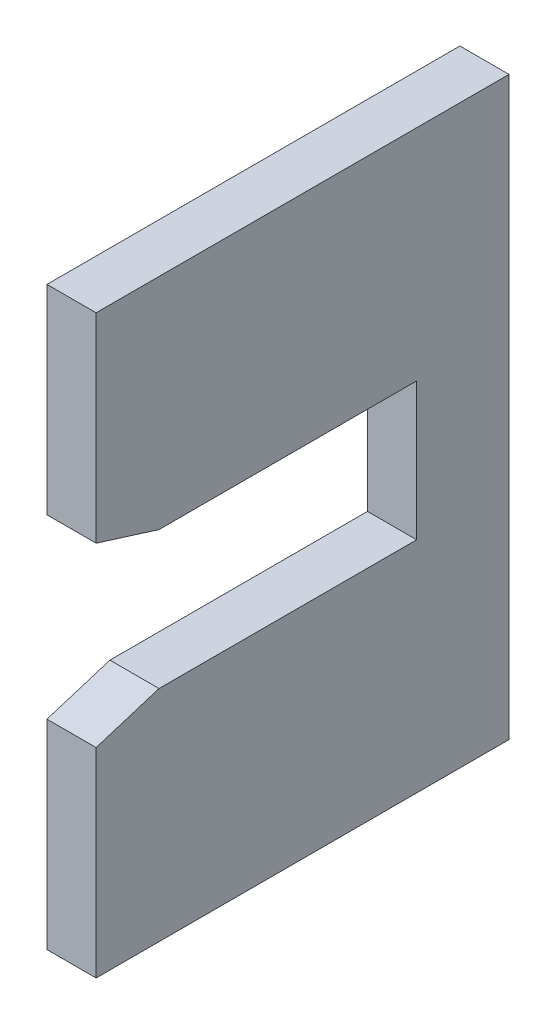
from build123d import *

# Parameters (mm, degrees)
ESQUISSE1_W             = 2.5
ESQUISSE1_H             = 29.3
EXTRUSION1_DEPTH        = 21
ENL_V_MAT_EXTRU_1_DEPTH = 42.630412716


with BuildPart() as part:
    # Esquisse1 → Extrusion1 (new body)
    with BuildSketch(Plane.XY):
        with Locations((15.562133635, -21.208628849)):
            Rectangle(ESQUISSE1_W, ESQUISSE1_H)
    extrude(amount=EXTRUSION1_DEPTH)

    # Esquisse2 → Enl_v. mat.-Extru.1 (cut, through all)
    with BuildSketch(Plane(origin=(16.812133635, 0, 0), x_dir=(0, 0, -1), z_dir=(1, 0, 0))):
        Polygon((-17.8, -17.708628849), (-4.697339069, -17.708628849), (-4.697339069, -24.708628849), (-17.8, -24.708628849), (-21, -25.708628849), (-21, -16.708628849), align=None)
    extrude(amount=-ENL_V_MAT_EXTRU_1_DEPTH, mode=Mode.SUBTRACT)


solid = part.part
